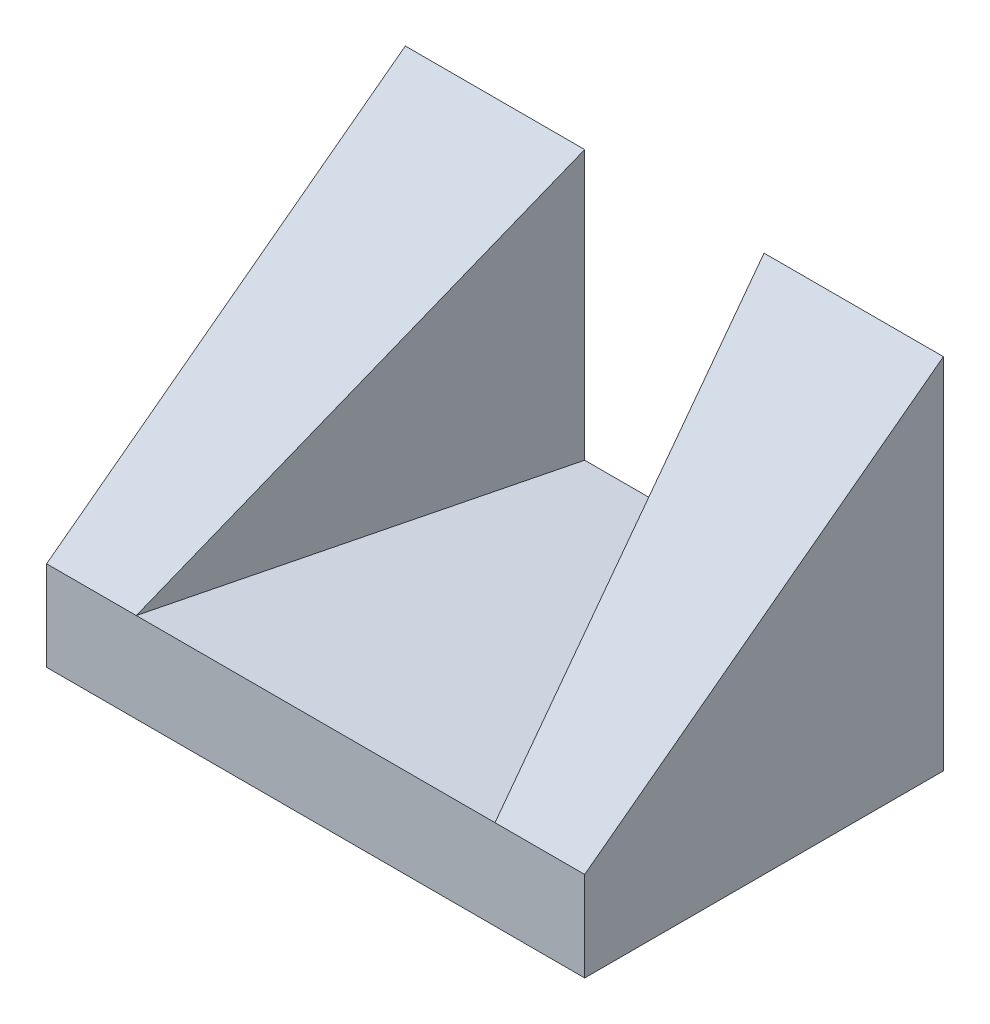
from build123d import *

# Parameters (mm, degrees)
EXTRUDE1_DEPTH = 30
EXTRUDE2_DEPTH = 30


with BuildPart() as part:
    # Sketch1 → Extrude1 (new, symmetric)
    with BuildSketch(Plane(origin=(0, 0, 0), x_dir=(0, 0, -1), z_dir=(1, 0, 0))):
        Polygon((0, -40), (0, 0), (-40, -30), (-40, -40), align=None)
    extrude(amount=EXTRUDE1_DEPTH, both=True)

    # Sketch2 → Extrude2 (cut)
    with BuildSketch(Plane(origin=(0, 0, 0), x_dir=(1, 0, 0), z_dir=(0, 1, 0))):
        Polygon((10, 0), (20, -40), (-20, -40), (-10, 0), align=None)
    extrude(amount=-EXTRUDE2_DEPTH, mode=Mode.SUBTRACT)


solid = part.part
